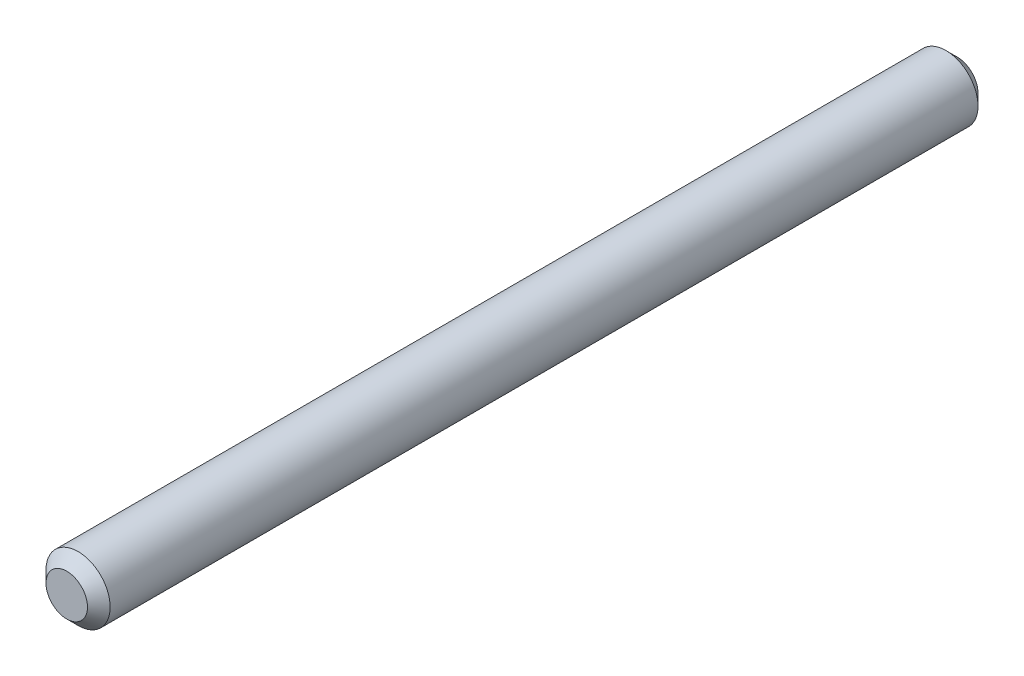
ISO-10303-21;
HEADER;
FILE_DESCRIPTION(('STEP AP214'),'2;1');
FILE_NAME('part.step','',(''),(''),'','','');
FILE_SCHEMA(('AUTOMOTIVE_DESIGN { 1 0 10303 214 1 1 1 1 }'));
ENDSEC;
DATA;
#1=APPLICATION_CONTEXT('core data for automotive mechanical design processes');
#2=APPLICATION_PROTOCOL_DEFINITION('international standard','automotive_design',2000,#1);
#3=PRODUCT_CONTEXT('',#1,'mechanical');
#4=PRODUCT('Part','Part','',(#3));
#5=PRODUCT_RELATED_PRODUCT_CATEGORY('part','',(#4));
#6=PRODUCT_DEFINITION_FORMATION('','',#4);
#7=PRODUCT_DEFINITION_CONTEXT('part definition',#1,'design');
#8=PRODUCT_DEFINITION('design','',#6,#7);
#9=PRODUCT_DEFINITION_SHAPE('','',#8);
#10=(LENGTH_UNIT() NAMED_UNIT(*) SI_UNIT(.MILLI.,.METRE.));
#11=(NAMED_UNIT(*) PLANE_ANGLE_UNIT() SI_UNIT($,.RADIAN.));
#12=(NAMED_UNIT(*) SI_UNIT($,.STERADIAN.) SOLID_ANGLE_UNIT());
#13=UNCERTAINTY_MEASURE_WITH_UNIT(LENGTH_MEASURE(1.E-05),#10,'distance_accuracy_value','');
#14=(GEOMETRIC_REPRESENTATION_CONTEXT(3) GLOBAL_UNCERTAINTY_ASSIGNED_CONTEXT((#13)) GLOBAL_UNIT_ASSIGNED_CONTEXT((#10,
#11,#12)) REPRESENTATION_CONTEXT('',''));
#15=CARTESIAN_POINT('',(0.,0.,0.));
#16=DIRECTION('',(0.,0.,1.));
#17=DIRECTION('',(1.,0.,0.));
#18=AXIS2_PLACEMENT_3D('',#15,#16,#17);
#19=CARTESIAN_POINT('',(0.,0.,54.96));
#20=DIRECTION('',(0.,0.,-1.));
#21=DIRECTION('',(-1.,0.,0.));
#22=AXIS2_PLACEMENT_3D('',#19,#20,#21);
#23=CYLINDRICAL_SURFACE('',#22,1.98);
#24=CARTESIAN_POINT('',(0.,0.,0.700000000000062));
#25=DIRECTION('',(0.,0.,1.));
#26=DIRECTION('',(1.,0.,0.));
#27=AXIS2_PLACEMENT_3D('',#24,#25,#26);
#28=CIRCLE('',#27,1.98);
#29=CARTESIAN_POINT('',(-1.98,0.,0.700000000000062));
#30=VERTEX_POINT('',#29);
#31=EDGE_CURVE('E43',#30,#30,#28,.T.);
#32=CARTESIAN_POINT('',(0.,0.,54.26));
#33=DIRECTION('',(0.,0.,1.));
#34=DIRECTION('',(1.,0.,0.));
#35=AXIS2_PLACEMENT_3D('',#32,#33,#34);
#36=CIRCLE('',#35,1.98);
#37=CARTESIAN_POINT('',(-1.98,0.,54.26));
#38=VERTEX_POINT('',#37);
#39=EDGE_CURVE('E47',#38,#38,#36,.F.);
#40=CARTESIAN_POINT('',(-1.98,0.,0.700000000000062));
#41=CARTESIAN_POINT('',(-1.98,0.,1.25791666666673));
#42=CARTESIAN_POINT('',(-1.98,0.,1.8158333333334));
#43=CARTESIAN_POINT('',(-1.98,0.,2.93166666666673));
#44=CARTESIAN_POINT('',(-1.98,0.,3.48958333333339));
#45=CARTESIAN_POINT('',(-1.98,0.,4.60541666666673));
#46=CARTESIAN_POINT('',(-1.98,0.,5.16333333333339));
#47=CARTESIAN_POINT('',(-1.98,0.,6.27916666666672));
#48=CARTESIAN_POINT('',(-1.98,0.,6.83708333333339));
#49=CARTESIAN_POINT('',(-1.98,0.,7.95291666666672));
#50=CARTESIAN_POINT('',(-1.98,0.,8.51083333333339));
#51=CARTESIAN_POINT('',(-1.98,0.,9.62666666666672));
#52=CARTESIAN_POINT('',(-1.98,0.,10.1845833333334));
#53=CARTESIAN_POINT('',(-1.98,0.,11.3004166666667));
#54=CARTESIAN_POINT('',(-1.98,0.,11.8583333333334));
#55=CARTESIAN_POINT('',(-1.98,0.,12.9741666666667));
#56=CARTESIAN_POINT('',(-1.98,0.,13.5320833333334));
#57=CARTESIAN_POINT('',(-1.98,0.,14.6479166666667));
#58=CARTESIAN_POINT('',(-1.98,0.,15.2058333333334));
#59=CARTESIAN_POINT('',(-1.98,0.,16.3216666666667));
#60=CARTESIAN_POINT('',(-1.98,0.,16.8795833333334));
#61=CARTESIAN_POINT('',(-1.98,0.,17.9954166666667));
#62=CARTESIAN_POINT('',(-1.98,0.,18.5533333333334));
#63=CARTESIAN_POINT('',(-1.98,0.,19.6691666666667));
#64=CARTESIAN_POINT('',(-1.98,0.,20.2270833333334));
#65=CARTESIAN_POINT('',(-1.98,0.,21.3429166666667));
#66=CARTESIAN_POINT('',(-1.98,0.,21.9008333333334));
#67=CARTESIAN_POINT('',(-1.98,0.,23.0166666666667));
#68=CARTESIAN_POINT('',(-1.98,0.,23.5745833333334));
#69=CARTESIAN_POINT('',(-1.98,0.,24.6904166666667));
#70=CARTESIAN_POINT('',(-1.98,0.,25.2483333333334));
#71=CARTESIAN_POINT('',(-1.98,0.,26.3641666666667));
#72=CARTESIAN_POINT('',(-1.98,0.,26.9220833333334));
#73=CARTESIAN_POINT('',(-1.98,0.,28.0379166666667));
#74=CARTESIAN_POINT('',(-1.98,0.,28.5958333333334));
#75=CARTESIAN_POINT('',(-1.98,0.,29.7116666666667));
#76=CARTESIAN_POINT('',(-1.98,0.,30.2695833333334));
#77=CARTESIAN_POINT('',(-1.98,0.,31.3854166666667));
#78=CARTESIAN_POINT('',(-1.98,0.,31.9433333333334));
#79=CARTESIAN_POINT('',(-1.98,0.,33.0591666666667));
#80=CARTESIAN_POINT('',(-1.98,0.,33.6170833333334));
#81=CARTESIAN_POINT('',(-1.98,0.,34.7329166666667));
#82=CARTESIAN_POINT('',(-1.98,0.,35.2908333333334));
#83=CARTESIAN_POINT('',(-1.98,0.,36.4066666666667));
#84=CARTESIAN_POINT('',(-1.98,0.,36.9645833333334));
#85=CARTESIAN_POINT('',(-1.98,0.,38.0804166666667));
#86=CARTESIAN_POINT('',(-1.98,0.,38.6383333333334));
#87=CARTESIAN_POINT('',(-1.98,0.,39.7541666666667));
#88=CARTESIAN_POINT('',(-1.98,0.,40.3120833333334));
#89=CARTESIAN_POINT('',(-1.98,0.,41.4279166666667));
#90=CARTESIAN_POINT('',(-1.98,0.,41.9858333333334));
#91=CARTESIAN_POINT('',(-1.98,0.,43.1016666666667));
#92=CARTESIAN_POINT('',(-1.98,0.,43.6595833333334));
#93=CARTESIAN_POINT('',(-1.98,0.,44.7754166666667));
#94=CARTESIAN_POINT('',(-1.98,0.,45.3333333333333));
#95=CARTESIAN_POINT('',(-1.98,0.,46.4491666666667));
#96=CARTESIAN_POINT('',(-1.98,0.,47.0070833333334));
#97=CARTESIAN_POINT('',(-1.98,0.,48.1229166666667));
#98=CARTESIAN_POINT('',(-1.98,0.,48.6808333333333));
#99=CARTESIAN_POINT('',(-1.98,0.,49.7966666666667));
#100=CARTESIAN_POINT('',(-1.98,0.,50.3545833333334));
#101=CARTESIAN_POINT('',(-1.98,0.,51.4704166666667));
#102=CARTESIAN_POINT('',(-1.98,0.,52.0283333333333));
#103=CARTESIAN_POINT('',(-1.98,0.,53.1441666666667));
#104=CARTESIAN_POINT('',(-1.98,0.,53.7020833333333));
#105=CARTESIAN_POINT('',(-1.98,0.,54.26));
#106=B_SPLINE_CURVE_WITH_KNOTS('',3,(#40,#41,#42,#43,#44,#45,#46,#47,#48,#49,#50,#51,#52,#53,
#54,#55,#56,#57,#58,#59,#60,#61,#62,#63,#64,#65,#66,#67,#68,#69,#70,#71,#72,#73,#74,#75,#76,#77,
#78,#79,#80,#81,#82,#83,#84,#85,#86,#87,#88,#89,#90,#91,#92,#93,#94,#95,#96,#97,#98,#99,#100,
#101,#102,#103,#104,#105),.UNSPECIFIED.,.F.,.F.,(4,2,2,2,2,2,2,2,2,2,2,2,2,2,2,2,2,2,2,2,2,2,2,
2,2,2,2,2,2,2,2,2,4),(0.,1.67375,3.3475,5.02125,6.69499999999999,8.36875,10.0425,11.71625,13.39,
15.06375,16.7375,18.41125,20.085,21.75875,23.4325,25.10625,26.78,28.45375,30.1275,31.80125,
33.475,35.14875,36.8225,38.49625,40.17,41.84375,43.5175,45.19125,46.865,48.53875,
50.2124999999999,51.8862499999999,53.5599999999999),.UNSPECIFIED.);
#107=EDGE_CURVE('BSEAM32',#30,#38,#106,.T.);
#108=ORIENTED_EDGE('',*,*,#31,.T.);
#109=ORIENTED_EDGE('',*,*,#39,.T.);
#110=ORIENTED_EDGE('',*,*,#107,.T.);
#111=ORIENTED_EDGE('',*,*,#107,.F.);
#112=EDGE_LOOP('',(#108,#110,#109,#111));
#113=FACE_BOUND('',#112,.T.);
#114=ADVANCED_FACE('F32',(#113),#23,.T.);
#115=CARTESIAN_POINT('',(0.,0.,54.96));
#116=DIRECTION('',(0.,0.,1.));
#117=DIRECTION('',(1.,0.,0.));
#118=AXIS2_PLACEMENT_3D('',#115,#116,#117);
#119=PLANE('',#118);
#120=CARTESIAN_POINT('',(0.,0.,54.96));
#121=DIRECTION('',(0.,0.,1.));
#122=DIRECTION('',(1.,0.,0.));
#123=AXIS2_PLACEMENT_3D('',#120,#121,#122);
#124=CIRCLE('',#123,1.28000000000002);
#125=CARTESIAN_POINT('',(1.28000000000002,0.,54.96));
#126=VERTEX_POINT('',#125);
#127=EDGE_CURVE('E10',#126,#126,#124,.T.);
#128=ORIENTED_EDGE('',*,*,#127,.T.);
#129=EDGE_LOOP('',(#128));
#130=FACE_BOUND('',#129,.T.);
#131=ADVANCED_FACE('F63',(#130),#119,.T.);
#132=CARTESIAN_POINT('',(0.,0.,0.));
#133=DIRECTION('',(0.,0.,1.));
#134=DIRECTION('',(1.,0.,0.));
#135=AXIS2_PLACEMENT_3D('',#132,#133,#134);
#136=PLANE('',#135);
#137=CARTESIAN_POINT('',(0.,0.,0.));
#138=DIRECTION('',(0.,0.,1.));
#139=DIRECTION('',(1.,0.,0.));
#140=AXIS2_PLACEMENT_3D('',#137,#138,#139);
#141=CIRCLE('',#140,1.27999999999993);
#142=CARTESIAN_POINT('',(1.27999999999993,0.,0.));
#143=VERTEX_POINT('',#142);
#144=EDGE_CURVE('E39',#143,#143,#141,.F.);
#145=ORIENTED_EDGE('',*,*,#144,.T.);
#146=EDGE_LOOP('',(#145));
#147=FACE_BOUND('',#146,.T.);
#148=ADVANCED_FACE('F60',(#147),#136,.F.);
#149=CARTESIAN_POINT('',(0.,0.,0.700000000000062));
#150=DIRECTION('',(0.,0.,1.));
#151=DIRECTION('',(1.,0.,0.));
#152=AXIS2_PLACEMENT_3D('',#149,#150,#151);
#153=CONICAL_SURFACE('',#152,1.98,0.785398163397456);
#154=ORIENTED_EDGE('',*,*,#144,.F.);
#155=EDGE_LOOP('',(#154));
#156=FACE_BOUND('',#155,.T.);
#157=ORIENTED_EDGE('',*,*,#31,.F.);
#158=EDGE_LOOP('',(#157));
#159=FACE_BOUND('',#158,.T.);
#160=ADVANCED_FACE('F56',(#156,#159),#153,.T.);
#161=CARTESIAN_POINT('',(0.,0.,54.96));
#162=DIRECTION('',(0.,0.,-1.));
#163=DIRECTION('',(-1.,0.,0.));
#164=AXIS2_PLACEMENT_3D('',#161,#162,#163);
#165=CONICAL_SURFACE('',#164,1.28000000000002,0.785398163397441);
#166=ORIENTED_EDGE('',*,*,#39,.F.);
#167=EDGE_LOOP('',(#166));
#168=FACE_BOUND('',#167,.T.);
#169=ORIENTED_EDGE('',*,*,#127,.F.);
#170=EDGE_LOOP('',(#169));
#171=FACE_BOUND('',#170,.T.);
#172=ADVANCED_FACE('F34',(#168,#171),#165,.T.);
#173=CLOSED_SHELL('',(#114,#131,#148,#160,#172));
#174=MANIFOLD_SOLID_BREP('B2',#173);
#175=ADVANCED_BREP_SHAPE_REPRESENTATION('',(#18,#174),#14);
#176=SHAPE_DEFINITION_REPRESENTATION(#9,#175);
ENDSEC;
END-ISO-10303-21;
